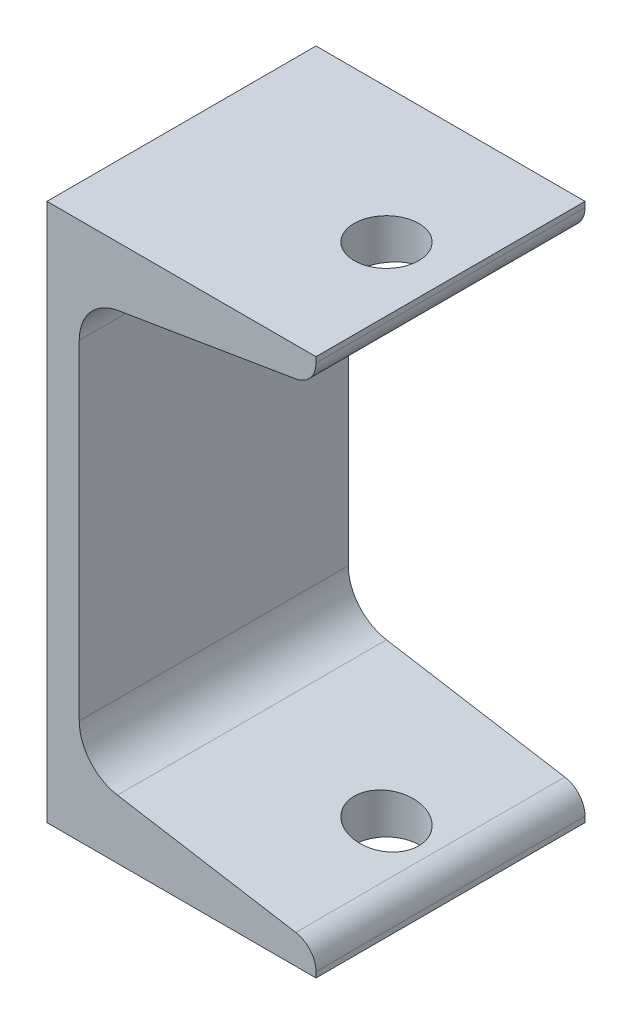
from build123d import *

# Parameters (mm, degrees)
BASEMCHANNEL_DEPTH              = 25
TOEFILLET_R                     = 4.5
SKIZZE1_R                       = 6
SCHNITT_LINEAR_AUSTRAGEN1_DEPTH = 115.564392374


with BuildPart() as part:
    # Sketch1 → BaseMchannel (new, symmetric)
    with BuildSketch(Plane.XY):
        with BuildLine():
            Line((50, 100), (0, 100))
            Line((0, 100), (0, 0))
            Line((0, 0), (50, 0))
            Line((50, 0), (50, 4.83306585))
            Line((50, 4.83306585), (13.102509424, 10.983096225))
            ThreePointArc((13.102509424, 10.983096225), (8.014297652, 13.873279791), (6, 19.367428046))
            Line((6, 19.367428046), (6, 80.632571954))
            ThreePointArc((6, 80.632571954), (8.014297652, 86.126720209), (13.102509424, 89.016903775))
            Line((13.102509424, 89.016903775), (50, 95.16693415))
            Line((50, 95.16693415), (50, 100))
        make_face()
    extrude(amount=BASEMCHANNEL_DEPTH, both=True)

    # ToeFillet
    toefillet_edges = [part.edges().sort_by_distance(p)[0] for p in [
        (50, 95.16693415, 0),
        (50, 4.83306585, 0),
    ]]
    fillet(toefillet_edges, radius=TOEFILLET_R)

    # Skizze1 → Schnitt-Linear austragen1 (cut, through all)
    with BuildSketch(Plane.XZ):
        with Locations((38.1, 0)):
            Circle(SKIZZE1_R)
    extrude(amount=-SCHNITT_LINEAR_AUSTRAGEN1_DEPTH, mode=Mode.SUBTRACT)


solid = part.part
